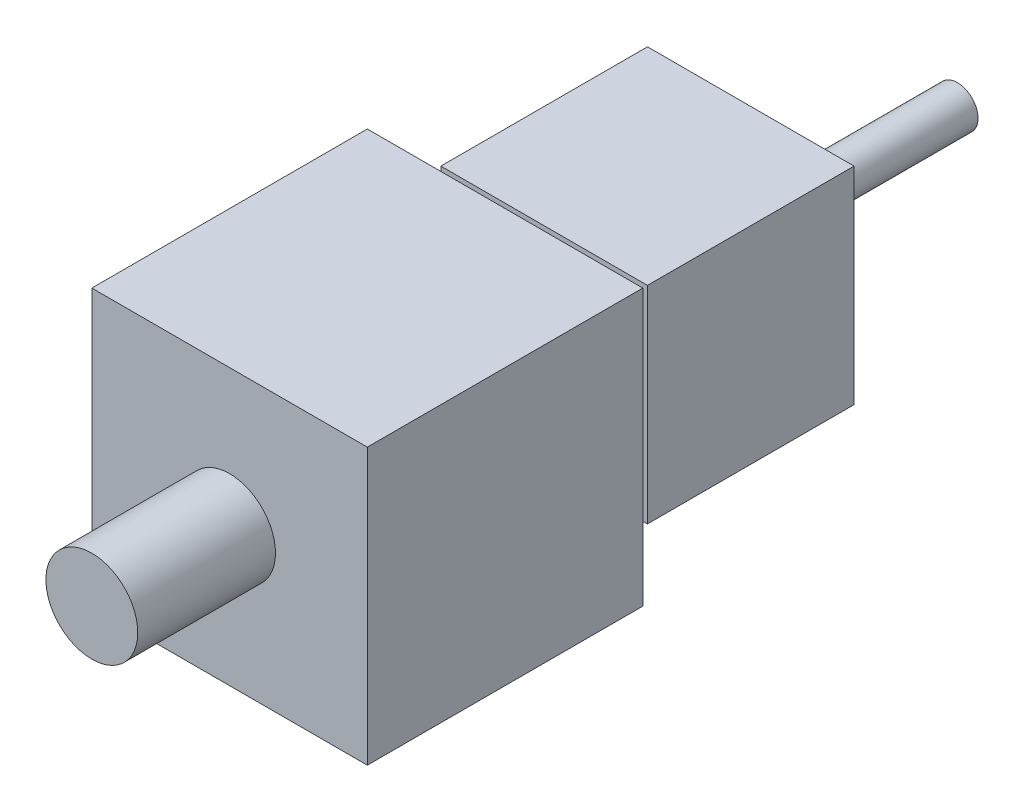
ISO-10303-21;
HEADER;
FILE_DESCRIPTION(('STEP AP214'),'2;1');
FILE_NAME('part.step','',(''),(''),'','','');
FILE_SCHEMA(('AUTOMOTIVE_DESIGN { 1 0 10303 214 1 1 1 1 }'));
ENDSEC;
DATA;
#1=APPLICATION_CONTEXT('core data for automotive mechanical design processes');
#2=APPLICATION_PROTOCOL_DEFINITION('international standard','automotive_design',2000,#1);
#3=PRODUCT_CONTEXT('',#1,'mechanical');
#4=PRODUCT('Part','Part','',(#3));
#5=PRODUCT_RELATED_PRODUCT_CATEGORY('part','',(#4));
#6=PRODUCT_DEFINITION_FORMATION('','',#4);
#7=PRODUCT_DEFINITION_CONTEXT('part definition',#1,'design');
#8=PRODUCT_DEFINITION('design','',#6,#7);
#9=PRODUCT_DEFINITION_SHAPE('','',#8);
#10=(LENGTH_UNIT() NAMED_UNIT(*) SI_UNIT(.MILLI.,.METRE.));
#11=(NAMED_UNIT(*) PLANE_ANGLE_UNIT() SI_UNIT($,.RADIAN.));
#12=(NAMED_UNIT(*) SI_UNIT($,.STERADIAN.) SOLID_ANGLE_UNIT());
#13=UNCERTAINTY_MEASURE_WITH_UNIT(LENGTH_MEASURE(1.E-05),#10,'distance_accuracy_value','');
#14=(GEOMETRIC_REPRESENTATION_CONTEXT(3) GLOBAL_UNCERTAINTY_ASSIGNED_CONTEXT((#13)) GLOBAL_UNIT_ASSIGNED_CONTEXT((#10,
#11,#12)) REPRESENTATION_CONTEXT('',''));
#15=CARTESIAN_POINT('',(0.,0.,0.));
#16=DIRECTION('',(0.,0.,1.));
#17=DIRECTION('',(1.,0.,0.));
#18=AXIS2_PLACEMENT_3D('',#15,#16,#17);
#19=CARTESIAN_POINT('',(7.5,7.5,-35.3373617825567));
#20=DIRECTION('',(0.,0.,1.));
#21=DIRECTION('',(1.,0.,0.));
#22=AXIS2_PLACEMENT_3D('',#19,#20,#21);
#23=CYLINDRICAL_SURFACE('',#22,1.5);
#24=CARTESIAN_POINT('',(7.5,7.5,-35.3373617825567));
#25=DIRECTION('',(0.,0.,-1.));
#26=DIRECTION('',(-1.,0.,0.));
#27=AXIS2_PLACEMENT_3D('',#24,#25,#26);
#28=CIRCLE('',#27,1.5);
#29=CARTESIAN_POINT('',(6.,7.5,-35.3373617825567));
#30=VERTEX_POINT('',#29);
#31=EDGE_CURVE('E11',#30,#30,#28,.T.);
#32=ORIENTED_EDGE('',*,*,#31,.F.);
#33=EDGE_LOOP('',(#32));
#34=FACE_BOUND('',#33,.T.);
#35=CARTESIAN_POINT('',(7.5,7.5,-20.3373617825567));
#36=DIRECTION('',(0.,0.,-1.));
#37=DIRECTION('',(-1.,0.,0.));
#38=AXIS2_PLACEMENT_3D('',#35,#36,#37);
#39=CIRCLE('',#38,1.5);
#40=CARTESIAN_POINT('',(6.,7.5,-20.3373617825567));
#41=VERTEX_POINT('',#40);
#42=EDGE_CURVE('E49',#41,#41,#39,.T.);
#43=ORIENTED_EDGE('',*,*,#42,.T.);
#44=EDGE_LOOP('',(#43));
#45=FACE_BOUND('',#44,.T.);
#46=ADVANCED_FACE('F46',(#34,#45),#23,.T.);
#47=CARTESIAN_POINT('',(7.5,7.5,-35.3373617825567));
#48=DIRECTION('',(0.,0.,-1.));
#49=DIRECTION('',(-1.,0.,0.));
#50=AXIS2_PLACEMENT_3D('',#47,#48,#49);
#51=PLANE('',#50);
#52=ORIENTED_EDGE('',*,*,#31,.T.);
#53=EDGE_LOOP('',(#52));
#54=FACE_BOUND('',#53,.T.);
#55=ADVANCED_FACE('F61',(#54),#51,.T.);
#56=CARTESIAN_POINT('',(7.5,7.5,-20.3373617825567));
#57=DIRECTION('',(0.,0.,-1.));
#58=DIRECTION('',(-1.,0.,0.));
#59=AXIS2_PLACEMENT_3D('',#56,#57,#58);
#60=PLANE('',#59);
#61=ORIENTED_EDGE('',*,*,#42,.F.);
#62=EDGE_LOOP('',(#61));
#63=FACE_BOUND('',#62,.T.);
#64=ADVANCED_FACE('F59',(#63),#60,.F.);
#65=CLOSED_SHELL('',(#46,#55,#64));
#66=MANIFOLD_SOLID_BREP('B2',#65);
#67=CARTESIAN_POINT('',(0.,0.,-20.3373617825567));
#68=DIRECTION('',(0.,-1.,0.));
#69=DIRECTION('',(0.,0.,-1.));
#70=AXIS2_PLACEMENT_3D('',#67,#68,#69);
#71=PLANE('',#70);
#72=DIRECTION('',(1.,0.,0.));
#73=VECTOR('',#72,1.);
#74=CARTESIAN_POINT('',(0.,0.,-5.33736178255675));
#75=LINE('',#74,#73);
#76=CARTESIAN_POINT('',(0.,0.,-5.33736178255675));
#77=VERTEX_POINT('',#76);
#78=CARTESIAN_POINT('',(15.,0.,-5.33736178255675));
#79=VERTEX_POINT('',#78);
#80=EDGE_CURVE('E159',#77,#79,#75,.T.);
#81=ORIENTED_EDGE('',*,*,#80,.F.);
#82=DIRECTION('',(0.,0.,1.));
#83=VECTOR('',#82,1.);
#84=CARTESIAN_POINT('',(0.,0.,-20.3373617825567));
#85=LINE('',#84,#83);
#86=CARTESIAN_POINT('',(0.,0.,-20.3373617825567));
#87=VERTEX_POINT('',#86);
#88=EDGE_CURVE('E44',#87,#77,#85,.T.);
#89=ORIENTED_EDGE('',*,*,#88,.F.);
#90=DIRECTION('',(1.,0.,0.));
#91=VECTOR('',#90,1.);
#92=CARTESIAN_POINT('',(0.,0.,-20.3373617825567));
#93=LINE('',#92,#91);
#94=CARTESIAN_POINT('',(15.,0.,-20.3373617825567));
#95=VERTEX_POINT('',#94);
#96=EDGE_CURVE('E153',#87,#95,#93,.T.);
#97=ORIENTED_EDGE('',*,*,#96,.T.);
#98=DIRECTION('',(0.,0.,1.));
#99=VECTOR('',#98,1.);
#100=CARTESIAN_POINT('',(15.,0.,-20.3373617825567));
#101=LINE('',#100,#99);
#102=EDGE_CURVE('E98',#95,#79,#101,.T.);
#103=ORIENTED_EDGE('',*,*,#102,.T.);
#104=EDGE_LOOP('',(#81,#89,#97,#103));
#105=FACE_BOUND('',#104,.T.);
#106=ADVANCED_FACE('F95',(#105),#71,.T.);
#107=CARTESIAN_POINT('',(0.,0.,-20.3373617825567));
#108=DIRECTION('',(-1.,0.,0.));
#109=DIRECTION('',(0.,0.,1.));
#110=AXIS2_PLACEMENT_3D('',#107,#108,#109);
#111=PLANE('',#110);
#112=DIRECTION('',(0.,-1.,0.));
#113=VECTOR('',#112,1.);
#114=CARTESIAN_POINT('',(0.,0.,-5.33736178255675));
#115=LINE('',#114,#113);
#116=CARTESIAN_POINT('',(0.,15.,-5.33736178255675));
#117=VERTEX_POINT('',#116);
#118=EDGE_CURVE('E155',#117,#77,#115,.T.);
#119=ORIENTED_EDGE('',*,*,#118,.F.);
#120=DIRECTION('',(0.,0.,1.));
#121=VECTOR('',#120,1.);
#122=CARTESIAN_POINT('',(0.,15.,-20.3373617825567));
#123=LINE('',#122,#121);
#124=CARTESIAN_POINT('',(0.,15.,-20.3373617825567));
#125=VERTEX_POINT('',#124);
#126=EDGE_CURVE('E104',#125,#117,#123,.T.);
#127=ORIENTED_EDGE('',*,*,#126,.F.);
#128=DIRECTION('',(0.,-1.,0.));
#129=VECTOR('',#128,1.);
#130=CARTESIAN_POINT('',(0.,0.,-20.3373617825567));
#131=LINE('',#130,#129);
#132=EDGE_CURVE('E150',#125,#87,#131,.T.);
#133=ORIENTED_EDGE('',*,*,#132,.T.);
#134=ORIENTED_EDGE('',*,*,#88,.T.);
#135=EDGE_LOOP('',(#119,#127,#133,#134));
#136=FACE_BOUND('',#135,.T.);
#137=ADVANCED_FACE('F169',(#136),#111,.T.);
#138=CARTESIAN_POINT('',(0.,15.,-20.3373617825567));
#139=DIRECTION('',(0.,1.,0.));
#140=DIRECTION('',(0.,0.,1.));
#141=AXIS2_PLACEMENT_3D('',#138,#139,#140);
#142=PLANE('',#141);
#143=DIRECTION('',(-1.,0.,0.));
#144=VECTOR('',#143,1.);
#145=CARTESIAN_POINT('',(0.,15.,-5.33736178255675));
#146=LINE('',#145,#144);
#147=CARTESIAN_POINT('',(15.,15.,-5.33736178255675));
#148=VERTEX_POINT('',#147);
#149=EDGE_CURVE('E145',#148,#117,#146,.T.);
#150=ORIENTED_EDGE('',*,*,#149,.F.);
#151=DIRECTION('',(0.,0.,1.));
#152=VECTOR('',#151,1.);
#153=CARTESIAN_POINT('',(15.,15.,-20.3373617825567));
#154=LINE('',#153,#152);
#155=CARTESIAN_POINT('',(15.,15.,-20.3373617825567));
#156=VERTEX_POINT('',#155);
#157=EDGE_CURVE('E140',#156,#148,#154,.T.);
#158=ORIENTED_EDGE('',*,*,#157,.F.);
#159=DIRECTION('',(-1.,0.,0.));
#160=VECTOR('',#159,1.);
#161=CARTESIAN_POINT('',(0.,15.,-20.3373617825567));
#162=LINE('',#161,#160);
#163=EDGE_CURVE('E143',#156,#125,#162,.T.);
#164=ORIENTED_EDGE('',*,*,#163,.T.);
#165=ORIENTED_EDGE('',*,*,#126,.T.);
#166=EDGE_LOOP('',(#150,#158,#164,#165));
#167=FACE_BOUND('',#166,.T.);
#168=ADVANCED_FACE('F142',(#167),#142,.T.);
#169=CARTESIAN_POINT('',(15.,0.,-20.3373617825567));
#170=DIRECTION('',(1.,0.,0.));
#171=DIRECTION('',(0.,0.,-1.));
#172=AXIS2_PLACEMENT_3D('',#169,#170,#171);
#173=PLANE('',#172);
#174=DIRECTION('',(0.,1.,0.));
#175=VECTOR('',#174,1.);
#176=CARTESIAN_POINT('',(15.,0.,-5.33736178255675));
#177=LINE('',#176,#175);
#178=EDGE_CURVE('E162',#79,#148,#177,.T.);
#179=ORIENTED_EDGE('',*,*,#178,.F.);
#180=ORIENTED_EDGE('',*,*,#102,.F.);
#181=DIRECTION('',(0.,1.,0.));
#182=VECTOR('',#181,1.);
#183=CARTESIAN_POINT('',(15.,0.,-20.3373617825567));
#184=LINE('',#183,#182);
#185=EDGE_CURVE('E149',#95,#156,#184,.T.);
#186=ORIENTED_EDGE('',*,*,#185,.T.);
#187=ORIENTED_EDGE('',*,*,#157,.T.);
#188=EDGE_LOOP('',(#179,#180,#186,#187));
#189=FACE_BOUND('',#188,.T.);
#190=ADVANCED_FACE('F152',(#189),#173,.T.);
#191=CARTESIAN_POINT('',(15.,0.,-20.3373617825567));
#192=DIRECTION('',(0.,0.,1.));
#193=DIRECTION('',(1.,0.,0.));
#194=AXIS2_PLACEMENT_3D('',#191,#192,#193);
#195=PLANE('',#194);
#196=ORIENTED_EDGE('',*,*,#96,.F.);
#197=ORIENTED_EDGE('',*,*,#132,.F.);
#198=ORIENTED_EDGE('',*,*,#163,.F.);
#199=ORIENTED_EDGE('',*,*,#185,.F.);
#200=EDGE_LOOP('',(#196,#197,#198,#199));
#201=FACE_BOUND('',#200,.T.);
#202=ADVANCED_FACE('F148',(#201),#195,.F.);
#203=CARTESIAN_POINT('',(15.,0.,-5.33736178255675));
#204=DIRECTION('',(0.,0.,1.));
#205=DIRECTION('',(1.,0.,0.));
#206=AXIS2_PLACEMENT_3D('',#203,#204,#205);
#207=PLANE('',#206);
#208=ORIENTED_EDGE('',*,*,#80,.T.);
#209=ORIENTED_EDGE('',*,*,#178,.T.);
#210=ORIENTED_EDGE('',*,*,#149,.T.);
#211=ORIENTED_EDGE('',*,*,#118,.T.);
#212=EDGE_LOOP('',(#208,#209,#210,#211));
#213=FACE_BOUND('',#212,.T.);
#214=ADVANCED_FACE('F168',(#213),#207,.T.);
#215=CLOSED_SHELL('',(#106,#137,#168,#190,#202,#214));
#216=MANIFOLD_SOLID_BREP('B6',#215);
#217=CARTESIAN_POINT('',(10.,10.,30.));
#218=DIRECTION('',(0.,0.,-1.));
#219=DIRECTION('',(-1.,0.,0.));
#220=AXIS2_PLACEMENT_3D('',#217,#218,#219);
#221=CYLINDRICAL_SURFACE('',#220,3.33333333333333);
#222=CARTESIAN_POINT('',(10.,10.,30.));
#223=DIRECTION('',(0.,0.,1.));
#224=DIRECTION('',(1.,0.,0.));
#225=AXIS2_PLACEMENT_3D('',#222,#223,#224);
#226=CIRCLE('',#225,3.33333333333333);
#227=CARTESIAN_POINT('',(13.3333333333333,10.,30.));
#228=VERTEX_POINT('',#227);
#229=EDGE_CURVE('E94',#228,#228,#226,.T.);
#230=ORIENTED_EDGE('',*,*,#229,.F.);
#231=EDGE_LOOP('',(#230));
#232=FACE_BOUND('',#231,.T.);
#233=CARTESIAN_POINT('',(10.,10.,20.));
#234=DIRECTION('',(0.,0.,1.));
#235=DIRECTION('',(1.,0.,0.));
#236=AXIS2_PLACEMENT_3D('',#233,#234,#235);
#237=CIRCLE('',#236,3.33333333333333);
#238=CARTESIAN_POINT('',(13.3333333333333,10.,20.));
#239=VERTEX_POINT('',#238);
#240=EDGE_CURVE('E231',#239,#239,#237,.T.);
#241=ORIENTED_EDGE('',*,*,#240,.T.);
#242=EDGE_LOOP('',(#241));
#243=FACE_BOUND('',#242,.T.);
#244=ADVANCED_FACE('F228',(#232,#243),#221,.T.);
#245=CARTESIAN_POINT('',(10.,10.,30.));
#246=DIRECTION('',(0.,0.,1.));
#247=DIRECTION('',(1.,0.,0.));
#248=AXIS2_PLACEMENT_3D('',#245,#246,#247);
#249=PLANE('',#248);
#250=ORIENTED_EDGE('',*,*,#229,.T.);
#251=EDGE_LOOP('',(#250));
#252=FACE_BOUND('',#251,.T.);
#253=ADVANCED_FACE('F243',(#252),#249,.T.);
#254=CARTESIAN_POINT('',(10.,10.,20.));
#255=DIRECTION('',(0.,0.,1.));
#256=DIRECTION('',(1.,0.,0.));
#257=AXIS2_PLACEMENT_3D('',#254,#255,#256);
#258=PLANE('',#257);
#259=ORIENTED_EDGE('',*,*,#240,.F.);
#260=EDGE_LOOP('',(#259));
#261=FACE_BOUND('',#260,.T.);
#262=ADVANCED_FACE('F241',(#261),#258,.F.);
#263=CLOSED_SHELL('',(#244,#253,#262));
#264=MANIFOLD_SOLID_BREP('B38',#263);
#265=CARTESIAN_POINT('',(0.,0.,20.));
#266=DIRECTION('',(1.,0.,0.));
#267=DIRECTION('',(0.,0.,-1.));
#268=AXIS2_PLACEMENT_3D('',#265,#266,#267);
#269=PLANE('',#268);
#270=DIRECTION('',(0.,-1.,0.));
#271=VECTOR('',#270,1.);
#272=CARTESIAN_POINT('',(0.,0.,0.));
#273=LINE('',#272,#271);
#274=CARTESIAN_POINT('',(0.,20.,0.));
#275=VERTEX_POINT('',#274);
#276=CARTESIAN_POINT('',(0.,0.,0.));
#277=VERTEX_POINT('',#276);
#278=EDGE_CURVE('E332',#275,#277,#273,.T.);
#279=ORIENTED_EDGE('',*,*,#278,.T.);
#280=DIRECTION('',(0.,0.,-1.));
#281=VECTOR('',#280,1.);
#282=CARTESIAN_POINT('',(0.,0.,20.));
#283=LINE('',#282,#281);
#284=CARTESIAN_POINT('',(0.,0.,20.));
#285=VERTEX_POINT('',#284);
#286=EDGE_CURVE('E226',#285,#277,#283,.T.);
#287=ORIENTED_EDGE('',*,*,#286,.F.);
#288=DIRECTION('',(0.,-1.,0.));
#289=VECTOR('',#288,1.);
#290=CARTESIAN_POINT('',(0.,0.,20.));
#291=LINE('',#290,#289);
#292=CARTESIAN_POINT('',(0.,20.,20.));
#293=VERTEX_POINT('',#292);
#294=EDGE_CURVE('E320',#293,#285,#291,.T.);
#295=ORIENTED_EDGE('',*,*,#294,.F.);
#296=DIRECTION('',(0.,0.,-1.));
#297=VECTOR('',#296,1.);
#298=CARTESIAN_POINT('',(0.,20.,20.));
#299=LINE('',#298,#297);
#300=EDGE_CURVE('E328',#293,#275,#299,.T.);
#301=ORIENTED_EDGE('',*,*,#300,.T.);
#302=EDGE_LOOP('',(#279,#287,#295,#301));
#303=FACE_BOUND('',#302,.T.);
#304=ADVANCED_FACE('F269',(#303),#269,.F.);
#305=CARTESIAN_POINT('',(0.,0.,20.));
#306=DIRECTION('',(0.,1.,0.));
#307=DIRECTION('',(0.,0.,1.));
#308=AXIS2_PLACEMENT_3D('',#305,#306,#307);
#309=PLANE('',#308);
#310=DIRECTION('',(1.,0.,0.));
#311=VECTOR('',#310,1.);
#312=CARTESIAN_POINT('',(0.,0.,0.));
#313=LINE('',#312,#311);
#314=CARTESIAN_POINT('',(20.,0.,0.));
#315=VERTEX_POINT('',#314);
#316=EDGE_CURVE('E324',#277,#315,#313,.T.);
#317=ORIENTED_EDGE('',*,*,#316,.T.);
#318=DIRECTION('',(0.,0.,-1.));
#319=VECTOR('',#318,1.);
#320=CARTESIAN_POINT('',(20.,0.,20.));
#321=LINE('',#320,#319);
#322=CARTESIAN_POINT('',(20.,0.,20.));
#323=VERTEX_POINT('',#322);
#324=EDGE_CURVE('E277',#323,#315,#321,.T.);
#325=ORIENTED_EDGE('',*,*,#324,.F.);
#326=DIRECTION('',(1.,0.,0.));
#327=VECTOR('',#326,1.);
#328=CARTESIAN_POINT('',(0.,0.,20.));
#329=LINE('',#328,#327);
#330=EDGE_CURVE('E315',#285,#323,#329,.T.);
#331=ORIENTED_EDGE('',*,*,#330,.F.);
#332=ORIENTED_EDGE('',*,*,#286,.T.);
#333=EDGE_LOOP('',(#317,#325,#331,#332));
#334=FACE_BOUND('',#333,.T.);
#335=ADVANCED_FACE('F323',(#334),#309,.F.);
#336=CARTESIAN_POINT('',(20.,0.,20.));
#337=DIRECTION('',(-1.,0.,0.));
#338=DIRECTION('',(0.,0.,1.));
#339=AXIS2_PLACEMENT_3D('',#336,#337,#338);
#340=PLANE('',#339);
#341=DIRECTION('',(0.,1.,0.));
#342=VECTOR('',#341,1.);
#343=CARTESIAN_POINT('',(20.,0.,0.));
#344=LINE('',#343,#342);
#345=CARTESIAN_POINT('',(20.,20.,0.));
#346=VERTEX_POINT('',#345);
#347=EDGE_CURVE('E302',#315,#346,#344,.T.);
#348=ORIENTED_EDGE('',*,*,#347,.T.);
#349=DIRECTION('',(0.,0.,-1.));
#350=VECTOR('',#349,1.);
#351=CARTESIAN_POINT('',(20.,20.,20.));
#352=LINE('',#351,#350);
#353=CARTESIAN_POINT('',(20.,20.,20.));
#354=VERTEX_POINT('',#353);
#355=EDGE_CURVE('E325',#354,#346,#352,.T.);
#356=ORIENTED_EDGE('',*,*,#355,.F.);
#357=DIRECTION('',(0.,1.,0.));
#358=VECTOR('',#357,1.);
#359=CARTESIAN_POINT('',(20.,0.,20.));
#360=LINE('',#359,#358);
#361=EDGE_CURVE('E318',#323,#354,#360,.T.);
#362=ORIENTED_EDGE('',*,*,#361,.F.);
#363=ORIENTED_EDGE('',*,*,#324,.T.);
#364=EDGE_LOOP('',(#348,#356,#362,#363));
#365=FACE_BOUND('',#364,.T.);
#366=ADVANCED_FACE('F326',(#365),#340,.F.);
#367=CARTESIAN_POINT('',(0.,20.,20.));
#368=DIRECTION('',(0.,-1.,0.));
#369=DIRECTION('',(1.,0.,0.));
#370=AXIS2_PLACEMENT_3D('',#367,#368,#369);
#371=PLANE('',#370);
#372=DIRECTION('',(-1.,0.,0.));
#373=VECTOR('',#372,1.);
#374=CARTESIAN_POINT('',(0.,20.,0.));
#375=LINE('',#374,#373);
#376=EDGE_CURVE('E308',#346,#275,#375,.T.);
#377=ORIENTED_EDGE('',*,*,#376,.T.);
#378=ORIENTED_EDGE('',*,*,#300,.F.);
#379=DIRECTION('',(-1.,0.,0.));
#380=VECTOR('',#379,1.);
#381=CARTESIAN_POINT('',(0.,20.,20.));
#382=LINE('',#381,#380);
#383=EDGE_CURVE('E285',#354,#293,#382,.T.);
#384=ORIENTED_EDGE('',*,*,#383,.F.);
#385=ORIENTED_EDGE('',*,*,#355,.T.);
#386=EDGE_LOOP('',(#377,#378,#384,#385));
#387=FACE_BOUND('',#386,.T.);
#388=ADVANCED_FACE('F339',(#387),#371,.F.);
#389=CARTESIAN_POINT('',(0.,20.,20.));
#390=DIRECTION('',(0.,0.,-1.));
#391=DIRECTION('',(-1.,0.,0.));
#392=AXIS2_PLACEMENT_3D('',#389,#390,#391);
#393=PLANE('',#392);
#394=ORIENTED_EDGE('',*,*,#294,.T.);
#395=ORIENTED_EDGE('',*,*,#330,.T.);
#396=ORIENTED_EDGE('',*,*,#361,.T.);
#397=ORIENTED_EDGE('',*,*,#383,.T.);
#398=EDGE_LOOP('',(#394,#395,#396,#397));
#399=FACE_BOUND('',#398,.T.);
#400=ADVANCED_FACE('F316',(#399),#393,.F.);
#401=CARTESIAN_POINT('',(0.,20.,0.));
#402=DIRECTION('',(0.,0.,-1.));
#403=DIRECTION('',(-1.,0.,0.));
#404=AXIS2_PLACEMENT_3D('',#401,#402,#403);
#405=PLANE('',#404);
#406=ORIENTED_EDGE('',*,*,#278,.F.);
#407=ORIENTED_EDGE('',*,*,#376,.F.);
#408=ORIENTED_EDGE('',*,*,#347,.F.);
#409=ORIENTED_EDGE('',*,*,#316,.F.);
#410=EDGE_LOOP('',(#406,#407,#408,#409));
#411=FACE_BOUND('',#410,.T.);
#412=ADVANCED_FACE('F342',(#411),#405,.T.);
#413=CLOSED_SHELL('',(#304,#335,#366,#388,#400,#412));
#414=MANIFOLD_SOLID_BREP('B89',#413);
#415=ADVANCED_BREP_SHAPE_REPRESENTATION('',(#18,#66,#216,#264,#414),#14);
#416=SHAPE_DEFINITION_REPRESENTATION(#9,#415);
ENDSEC;
END-ISO-10303-21;
